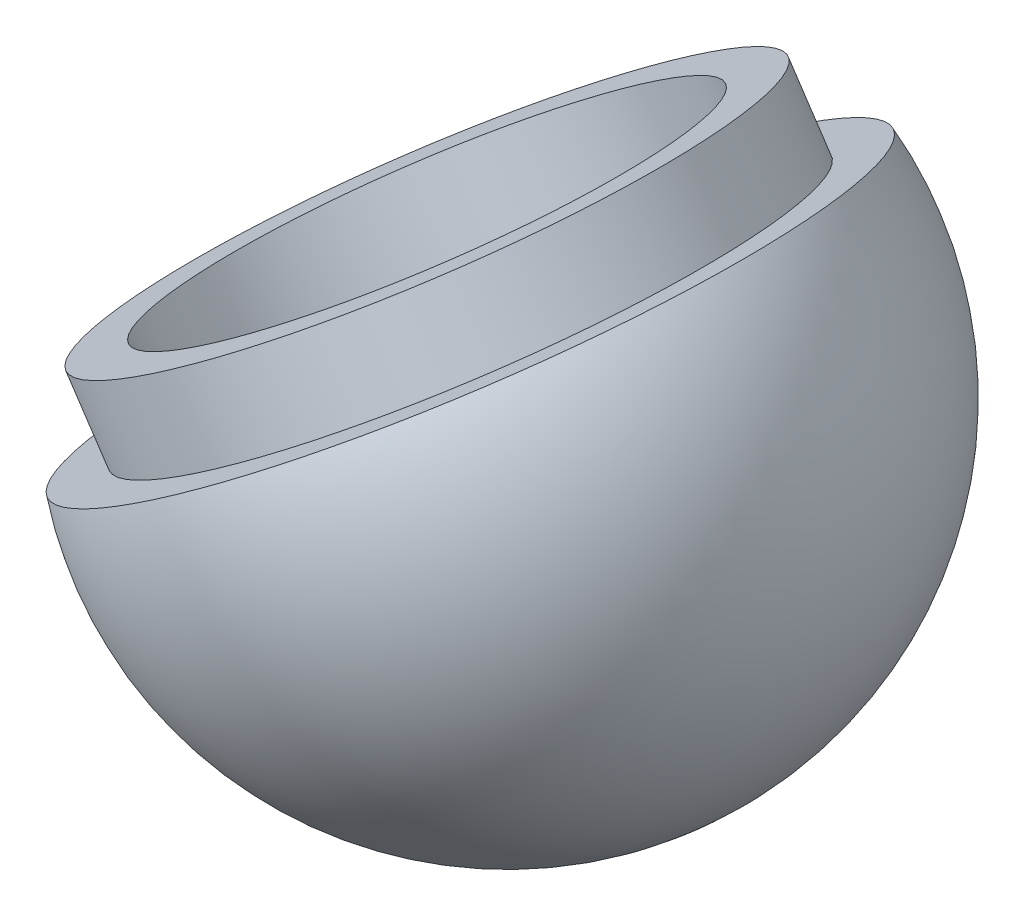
from build123d import *


with BuildPart() as part:
    # Szkic8 → Obr_t3 (revolve)
    with BuildSketch(Plane.XY, mode=Mode.PRIVATE) as obr_t3_sk:
        with BuildLine():
            Line((35.149486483, 35.56), (29.192067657, 31.572506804))
            Line((29.192067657, 31.572506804), (22.694514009, 41.280021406))
            Line((22.694514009, 41.280021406), (16.679698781, 37.25411094))
            Line((16.679698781, 37.25411094), (23.17725243, 27.546596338))
            ThreePointArc((23.17725243, 27.546596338), (35.945934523, -1.972255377), (20.024384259, -29.916952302))
            Line((20.024384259, -29.916952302), (27.811644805, -41.551322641))
            ThreePointArc((27.811644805, -41.551322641), (49.775144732, -4.736556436), (35.149486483, 35.56))
        make_face()
    revolve(obr_t3_sk.sketch.rotate(Axis((0, 0, 0), (0.5562328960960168, -0.831026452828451, 0)), 180), axis=Axis((0, 0, 0), (0.5562328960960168, -0.831026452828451, 0)))


solid = part.part
